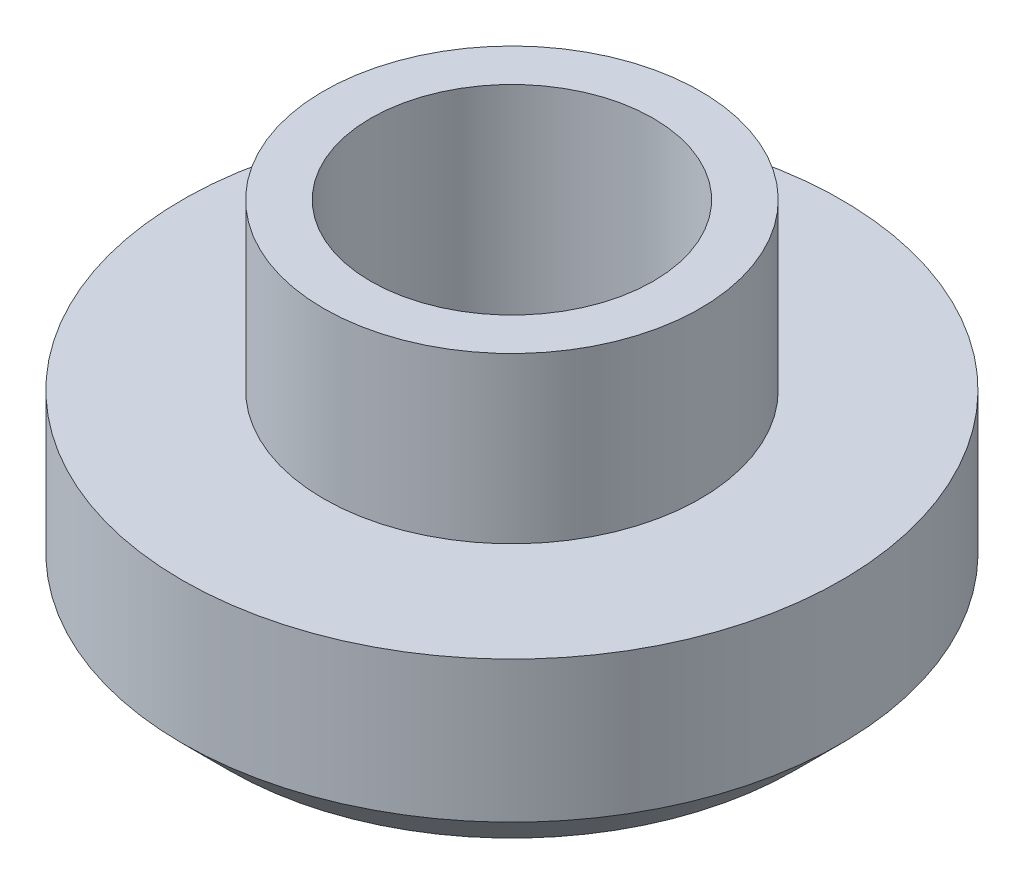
ISO-10303-21;
HEADER;
FILE_DESCRIPTION(('STEP AP214'),'2;1');
FILE_NAME('part.step','',(''),(''),'','','');
FILE_SCHEMA(('AUTOMOTIVE_DESIGN { 1 0 10303 214 1 1 1 1 }'));
ENDSEC;
DATA;
#1=APPLICATION_CONTEXT('core data for automotive mechanical design processes');
#2=APPLICATION_PROTOCOL_DEFINITION('international standard','automotive_design',2000,#1);
#3=PRODUCT_CONTEXT('',#1,'mechanical');
#4=PRODUCT('Part','Part','',(#3));
#5=PRODUCT_RELATED_PRODUCT_CATEGORY('part','',(#4));
#6=PRODUCT_DEFINITION_FORMATION('','',#4);
#7=PRODUCT_DEFINITION_CONTEXT('part definition',#1,'design');
#8=PRODUCT_DEFINITION('design','',#6,#7);
#9=PRODUCT_DEFINITION_SHAPE('','',#8);
#10=(LENGTH_UNIT() NAMED_UNIT(*) SI_UNIT(.MILLI.,.METRE.));
#11=(NAMED_UNIT(*) PLANE_ANGLE_UNIT() SI_UNIT($,.RADIAN.));
#12=(NAMED_UNIT(*) SI_UNIT($,.STERADIAN.) SOLID_ANGLE_UNIT());
#13=UNCERTAINTY_MEASURE_WITH_UNIT(LENGTH_MEASURE(1.E-05),#10,'distance_accuracy_value','');
#14=(GEOMETRIC_REPRESENTATION_CONTEXT(3) GLOBAL_UNCERTAINTY_ASSIGNED_CONTEXT((#13)) GLOBAL_UNIT_ASSIGNED_CONTEXT((#10,
#11,#12)) REPRESENTATION_CONTEXT('',''));
#15=CARTESIAN_POINT('',(0.,0.,0.));
#16=DIRECTION('',(0.,0.,1.));
#17=DIRECTION('',(1.,0.,0.));
#18=AXIS2_PLACEMENT_3D('',#15,#16,#17);
#19=CARTESIAN_POINT('',(0.,4.,0.));
#20=DIRECTION('',(0.,1.,0.));
#21=DIRECTION('',(0.,0.,1.));
#22=AXIS2_PLACEMENT_3D('',#19,#20,#21);
#23=PLANE('',#22);
#24=CARTESIAN_POINT('',(0.,4.,0.));
#25=DIRECTION('',(0.,1.,0.));
#26=DIRECTION('',(0.,0.,1.));
#27=AXIS2_PLACEMENT_3D('',#24,#25,#26);
#28=CIRCLE('',#27,7.);
#29=CARTESIAN_POINT('',(0.,4.,7.));
#30=VERTEX_POINT('',#29);
#31=EDGE_CURVE('E51',#30,#30,#28,.T.);
#32=ORIENTED_EDGE('',*,*,#31,.T.);
#33=EDGE_LOOP('',(#32));
#34=FACE_BOUND('',#33,.T.);
#35=CARTESIAN_POINT('',(0.,4.,0.));
#36=DIRECTION('',(0.,1.,0.));
#37=DIRECTION('',(0.,0.,1.));
#38=AXIS2_PLACEMENT_3D('',#35,#36,#37);
#39=CIRCLE('',#38,4.);
#40=CARTESIAN_POINT('',(0.,4.,4.));
#41=VERTEX_POINT('',#40);
#42=EDGE_CURVE('E58',#41,#41,#39,.T.);
#43=ORIENTED_EDGE('',*,*,#42,.F.);
#44=EDGE_LOOP('',(#43));
#45=FACE_BOUND('',#44,.T.);
#46=ADVANCED_FACE('F40',(#34,#45),#23,.T.);
#47=CARTESIAN_POINT('',(0.,4.,0.));
#48=DIRECTION('',(0.,-1.,0.));
#49=DIRECTION('',(0.,0.,-1.));
#50=AXIS2_PLACEMENT_3D('',#47,#48,#49);
#51=CYLINDRICAL_SURFACE('',#50,7.);
#52=CARTESIAN_POINT('',(0.,1.,0.));
#53=DIRECTION('',(0.,1.,0.));
#54=DIRECTION('',(0.,0.,1.));
#55=AXIS2_PLACEMENT_3D('',#52,#53,#54);
#56=CIRCLE('',#55,7.);
#57=CARTESIAN_POINT('',(0.,1.,7.));
#58=VERTEX_POINT('',#57);
#59=EDGE_CURVE('E47',#58,#58,#56,.T.);
#60=ORIENTED_EDGE('',*,*,#59,.T.);
#61=EDGE_LOOP('',(#60));
#62=FACE_BOUND('',#61,.T.);
#63=ORIENTED_EDGE('',*,*,#31,.F.);
#64=EDGE_LOOP('',(#63));
#65=FACE_BOUND('',#64,.T.);
#66=ADVANCED_FACE('F91',(#62,#65),#51,.T.);
#67=CARTESIAN_POINT('',(0.,0.,0.));
#68=DIRECTION('',(0.,1.,0.));
#69=DIRECTION('',(0.,0.,1.));
#70=AXIS2_PLACEMENT_3D('',#67,#68,#69);
#71=PLANE('',#70);
#72=CARTESIAN_POINT('',(0.,0.,0.));
#73=DIRECTION('',(0.,1.,0.));
#74=DIRECTION('',(0.,0.,1.));
#75=AXIS2_PLACEMENT_3D('',#72,#73,#74);
#76=CIRCLE('',#75,5.99999999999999);
#77=CARTESIAN_POINT('',(0.,0.,5.99999999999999));
#78=VERTEX_POINT('',#77);
#79=EDGE_CURVE('E12',#78,#78,#76,.F.);
#80=ORIENTED_EDGE('',*,*,#79,.T.);
#81=EDGE_LOOP('',(#80));
#82=FACE_BOUND('',#81,.T.);
#83=CARTESIAN_POINT('',(0.,0.,0.));
#84=DIRECTION('',(0.,1.,0.));
#85=DIRECTION('',(0.,0.,1.));
#86=AXIS2_PLACEMENT_3D('',#83,#84,#85);
#87=CIRCLE('',#86,3.);
#88=CARTESIAN_POINT('',(0.,0.,3.));
#89=VERTEX_POINT('',#88);
#90=EDGE_CURVE('E61',#89,#89,#87,.T.);
#91=ORIENTED_EDGE('',*,*,#90,.T.);
#92=EDGE_LOOP('',(#91));
#93=FACE_BOUND('',#92,.T.);
#94=ADVANCED_FACE('F70',(#82,#93),#71,.F.);
#95=CARTESIAN_POINT('',(0.,7.5,0.));
#96=DIRECTION('',(0.,-1.,0.));
#97=DIRECTION('',(0.,0.,-1.));
#98=AXIS2_PLACEMENT_3D('',#95,#96,#97);
#99=CYLINDRICAL_SURFACE('',#98,4.);
#100=CARTESIAN_POINT('',(0.,7.5,0.));
#101=DIRECTION('',(0.,1.,0.));
#102=DIRECTION('',(0.,0.,1.));
#103=AXIS2_PLACEMENT_3D('',#100,#101,#102);
#104=CIRCLE('',#103,4.);
#105=CARTESIAN_POINT('',(0.,7.5,4.));
#106=VERTEX_POINT('',#105);
#107=EDGE_CURVE('E55',#106,#106,#104,.T.);
#108=ORIENTED_EDGE('',*,*,#107,.F.);
#109=EDGE_LOOP('',(#108));
#110=FACE_BOUND('',#109,.T.);
#111=ORIENTED_EDGE('',*,*,#42,.T.);
#112=EDGE_LOOP('',(#111));
#113=FACE_BOUND('',#112,.T.);
#114=ADVANCED_FACE('F81',(#110,#113),#99,.T.);
#115=CARTESIAN_POINT('',(0.,7.5,0.));
#116=DIRECTION('',(0.,1.,0.));
#117=DIRECTION('',(0.,0.,1.));
#118=AXIS2_PLACEMENT_3D('',#115,#116,#117);
#119=PLANE('',#118);
#120=CARTESIAN_POINT('',(0.,7.5,0.));
#121=DIRECTION('',(0.,1.,0.));
#122=DIRECTION('',(0.,0.,1.));
#123=AXIS2_PLACEMENT_3D('',#120,#121,#122);
#124=CIRCLE('',#123,3.);
#125=CARTESIAN_POINT('',(0.,7.5,3.));
#126=VERTEX_POINT('',#125);
#127=EDGE_CURVE('E64',#126,#126,#124,.T.);
#128=ORIENTED_EDGE('',*,*,#127,.F.);
#129=EDGE_LOOP('',(#128));
#130=FACE_BOUND('',#129,.T.);
#131=ORIENTED_EDGE('',*,*,#107,.T.);
#132=EDGE_LOOP('',(#131));
#133=FACE_BOUND('',#132,.T.);
#134=ADVANCED_FACE('F75',(#130,#133),#119,.T.);
#135=CARTESIAN_POINT('',(0.,0.,0.));
#136=DIRECTION('',(0.,1.,0.));
#137=DIRECTION('',(0.,0.,1.));
#138=AXIS2_PLACEMENT_3D('',#135,#136,#137);
#139=CYLINDRICAL_SURFACE('',#138,3.);
#140=ORIENTED_EDGE('',*,*,#90,.F.);
#141=EDGE_LOOP('',(#140));
#142=FACE_BOUND('',#141,.T.);
#143=ORIENTED_EDGE('',*,*,#127,.T.);
#144=EDGE_LOOP('',(#143));
#145=FACE_BOUND('',#144,.T.);
#146=ADVANCED_FACE('F72',(#142,#145),#139,.F.);
#147=CARTESIAN_POINT('',(0.,1.,0.));
#148=DIRECTION('',(0.,1.,0.));
#149=DIRECTION('',(0.,0.,1.));
#150=AXIS2_PLACEMENT_3D('',#147,#148,#149);
#151=CONICAL_SURFACE('',#150,7.,0.78539816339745);
#152=ORIENTED_EDGE('',*,*,#79,.F.);
#153=EDGE_LOOP('',(#152));
#154=FACE_BOUND('',#153,.T.);
#155=ORIENTED_EDGE('',*,*,#59,.F.);
#156=EDGE_LOOP('',(#155));
#157=FACE_BOUND('',#156,.T.);
#158=ADVANCED_FACE('F42',(#154,#157),#151,.T.);
#159=CLOSED_SHELL('',(#46,#66,#94,#114,#134,#146,#158));
#160=MANIFOLD_SOLID_BREP('B2',#159);
#161=ADVANCED_BREP_SHAPE_REPRESENTATION('',(#18,#160),#14);
#162=SHAPE_DEFINITION_REPRESENTATION(#9,#161);
ENDSEC;
END-ISO-10303-21;
